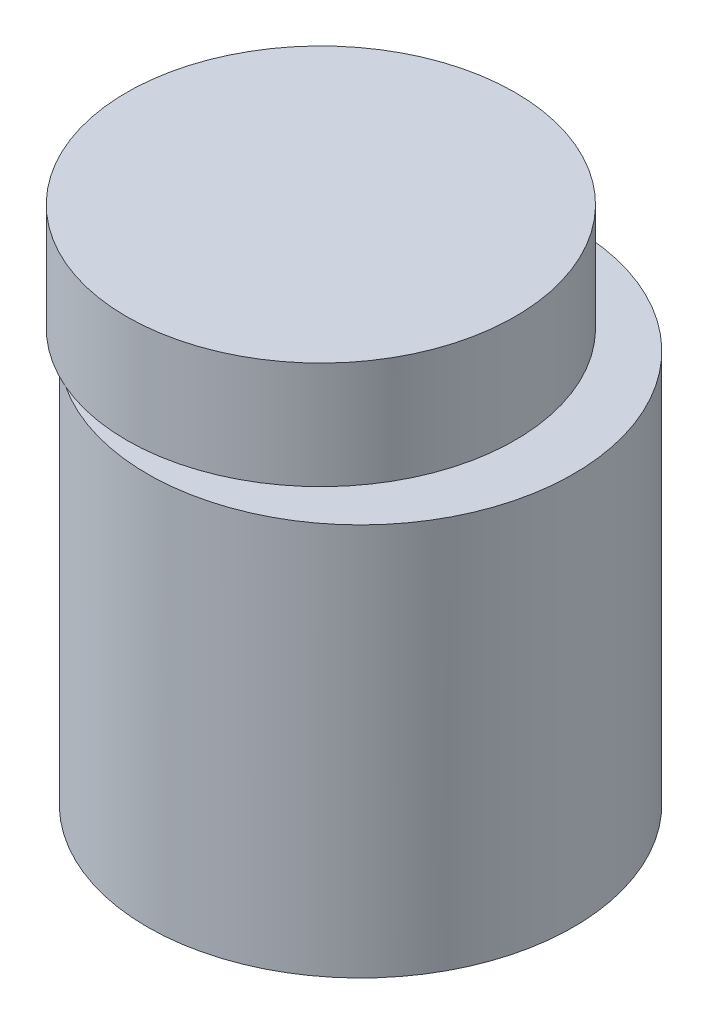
from build123d import *

# Parameters (mm, degrees)
SKIZZE1_R                       = 5.375
AUFSATZ_LINEAR_AUSTRAGEN1_DEPTH = 10
SKIZZE3_R                       = 5.4
AUFSATZ_LINEAR_AUSTRAGEN3_DEPTH = 10
SKIZZE5_R                       = 5.4
AUFSATZ_LINEAR_AUSTRAGEN4_DEPTH = 7.9
SKIZZE6_R                       = 4.9
AUFSATZ_LINEAR_AUSTRAGEN5_DEPTH = 2.7
SKIZZE8_R                       = 2.6
SCHNITT_LINEAR_AUSTRAGEN1_DEPTH = 25
SKIZZE9_W                       = 0.55
SKIZZE9_H                       = 3.199050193
AUFSATZ_LINEAR_AUSTRAGEN6_DEPTH = 15
SKIZZE10_W                      = 20.815127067
SKIZZE10_H                      = 15.6113453
SCHNITT_LINEAR_AUSTRAGEN2_DEPTH = 18


with BuildPart() as part:
    # Skizze1 → Aufsatz-Linear austragen1 (new body)
    with BuildSketch(Plane(origin=(0, 0, 0), x_dir=(1, 0, 0), z_dir=(0, 1, 0))):
        with Locations(Location((0, 0, 0), (0, 0, 270))):
            Circle(SKIZZE1_R)
    extrude(amount=AUFSATZ_LINEAR_AUSTRAGEN1_DEPTH)

    # Skizze3 → Aufsatz-Linear austragen3 (add)
    with BuildSketch(Plane(origin=(0, 0, 0), x_dir=(-1, 0, 0), z_dir=(0, -1, 0))):
        with Locations(Location((2, 0, 0), (0, 0, 258.600063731))):
            Circle(SKIZZE3_R)
    extrude(amount=AUFSATZ_LINEAR_AUSTRAGEN3_DEPTH)

    # Skizze5 → Aufsatz-Linear austragen4 (add)
    with BuildSketch(Plane.XZ.offset(10)):
        with Locations(Location((-1, 0, 0), (0, 0, 95.312774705))):
            Circle(SKIZZE5_R)
    extrude(amount=AUFSATZ_LINEAR_AUSTRAGEN4_DEPTH)

    # Skizze6 → Aufsatz-Linear austragen5 (add)
    with BuildSketch(Plane(origin=(0, 10, 0), x_dir=(1, 0, 0), z_dir=(0, 1, 0))):
        with Locations(Location((-1, 0, 0), (0, 0, 113.327241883))):
            Circle(SKIZZE6_R)
    extrude(amount=AUFSATZ_LINEAR_AUSTRAGEN5_DEPTH)

    # Skizze8 → Schnitt-Linear austragen1 (cut)
    with BuildSketch(Plane.XZ.offset(17.9)):
        with Locations(Location((-1, 0, 0), (0, 0, 270))):
            Circle(SKIZZE8_R)
    extrude(amount=-SCHNITT_LINEAR_AUSTRAGEN1_DEPTH, mode=Mode.SUBTRACT)

    # Skizze9 → Aufsatz-Linear austragen6 (add)
    with BuildSketch(Plane(origin=(0, 7.1, 0), x_dir=(-1, 0, 0), z_dir=(0, -1, 0))):
        with Locations((-1.325, 0.000306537)):
            Rectangle(SKIZZE9_W, SKIZZE9_H)
    extrude(amount=AUFSATZ_LINEAR_AUSTRAGEN6_DEPTH)

    # Skizze10 → Schnitt-Linear austragen2 (cut)
    with BuildSketch(Plane.XZ.offset(17.9)):
        with Locations((-0.021672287, -0.065047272)):
            Rectangle(SKIZZE10_W, SKIZZE10_H)
    extrude(amount=-SCHNITT_LINEAR_AUSTRAGEN2_DEPTH, mode=Mode.SUBTRACT)


solid = part.part
